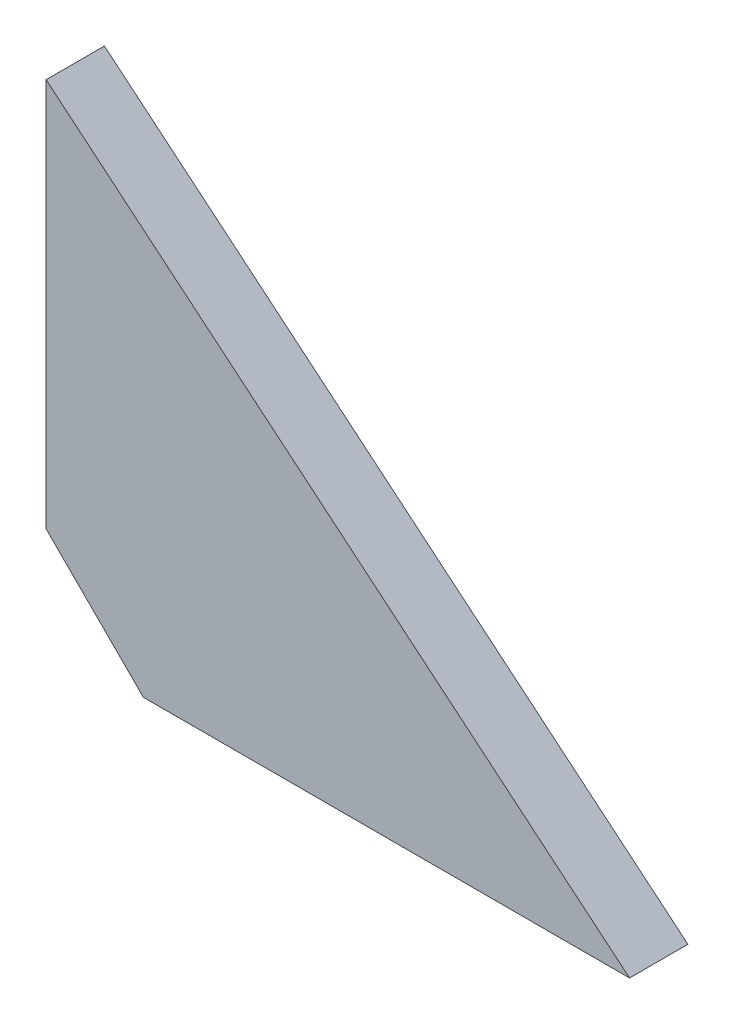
ISO-10303-21;
HEADER;
FILE_DESCRIPTION(('STEP AP214'),'2;1');
FILE_NAME('part.step','',(''),(''),'','','');
FILE_SCHEMA(('AUTOMOTIVE_DESIGN { 1 0 10303 214 1 1 1 1 }'));
ENDSEC;
DATA;
#1=APPLICATION_CONTEXT('core data for automotive mechanical design processes');
#2=APPLICATION_PROTOCOL_DEFINITION('international standard','automotive_design',2000,#1);
#3=PRODUCT_CONTEXT('',#1,'mechanical');
#4=PRODUCT('Part','Part','',(#3));
#5=PRODUCT_RELATED_PRODUCT_CATEGORY('part','',(#4));
#6=PRODUCT_DEFINITION_FORMATION('','',#4);
#7=PRODUCT_DEFINITION_CONTEXT('part definition',#1,'design');
#8=PRODUCT_DEFINITION('design','',#6,#7);
#9=PRODUCT_DEFINITION_SHAPE('','',#8);
#10=(LENGTH_UNIT() NAMED_UNIT(*) SI_UNIT(.MILLI.,.METRE.));
#11=(NAMED_UNIT(*) PLANE_ANGLE_UNIT() SI_UNIT($,.RADIAN.));
#12=(NAMED_UNIT(*) SI_UNIT($,.STERADIAN.) SOLID_ANGLE_UNIT());
#13=UNCERTAINTY_MEASURE_WITH_UNIT(LENGTH_MEASURE(1.E-05),#10,'distance_accuracy_value','');
#14=(GEOMETRIC_REPRESENTATION_CONTEXT(3) GLOBAL_UNCERTAINTY_ASSIGNED_CONTEXT((#13)) GLOBAL_UNIT_ASSIGNED_CONTEXT((#10,
#11,#12)) REPRESENTATION_CONTEXT('',''));
#15=CARTESIAN_POINT('',(0.,0.,0.));
#16=DIRECTION('',(0.,0.,1.));
#17=DIRECTION('',(1.,0.,0.));
#18=AXIS2_PLACEMENT_3D('',#15,#16,#17);
#19=CARTESIAN_POINT('',(60.,0.,6.));
#20=DIRECTION('',(-0.64018439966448,-0.768221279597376,0.));
#21=DIRECTION('',(0.768221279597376,-0.64018439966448,0.));
#22=AXIS2_PLACEMENT_3D('',#19,#20,#21);
#23=PLANE('',#22);
#24=DIRECTION('',(-0.768221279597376,0.64018439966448,0.));
#25=VECTOR('',#24,1.);
#26=CARTESIAN_POINT('',(60.,0.,0.));
#27=LINE('',#26,#25);
#28=CARTESIAN_POINT('',(60.,0.,0.));
#29=VERTEX_POINT('',#28);
#30=CARTESIAN_POINT('',(0.,50.,0.));
#31=VERTEX_POINT('',#30);
#32=EDGE_CURVE('E96',#29,#31,#27,.T.);
#33=ORIENTED_EDGE('',*,*,#32,.T.);
#34=DIRECTION('',(0.,0.,-1.));
#35=VECTOR('',#34,1.);
#36=CARTESIAN_POINT('',(0.,50.,6.));
#37=LINE('',#36,#35);
#38=CARTESIAN_POINT('',(0.,50.,6.));
#39=VERTEX_POINT('',#38);
#40=EDGE_CURVE('E80',#39,#31,#37,.T.);
#41=ORIENTED_EDGE('',*,*,#40,.F.);
#42=DIRECTION('',(-0.768221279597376,0.64018439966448,0.));
#43=VECTOR('',#42,1.);
#44=CARTESIAN_POINT('',(60.,0.,6.));
#45=LINE('',#44,#43);
#46=CARTESIAN_POINT('',(60.,0.,6.));
#47=VERTEX_POINT('',#46);
#48=EDGE_CURVE('E85',#47,#39,#45,.T.);
#49=ORIENTED_EDGE('',*,*,#48,.F.);
#50=DIRECTION('',(0.,0.,-1.));
#51=VECTOR('',#50,1.);
#52=CARTESIAN_POINT('',(60.,0.,6.));
#53=LINE('',#52,#51);
#54=EDGE_CURVE('E98',#47,#29,#53,.T.);
#55=ORIENTED_EDGE('',*,*,#54,.T.);
#56=EDGE_LOOP('',(#33,#41,#49,#55));
#57=FACE_BOUND('',#56,.T.);
#58=ADVANCED_FACE('F39',(#57),#23,.F.);
#59=CARTESIAN_POINT('',(0.,50.,6.));
#60=DIRECTION('',(1.,0.,0.));
#61=DIRECTION('',(0.,1.,0.));
#62=AXIS2_PLACEMENT_3D('',#59,#60,#61);
#63=PLANE('',#62);
#64=DIRECTION('',(0.,-1.,0.));
#65=VECTOR('',#64,1.);
#66=CARTESIAN_POINT('',(0.,50.,0.));
#67=LINE('',#66,#65);
#68=CARTESIAN_POINT('',(0.,10.,0.));
#69=VERTEX_POINT('',#68);
#70=EDGE_CURVE('E106',#31,#69,#67,.T.);
#71=ORIENTED_EDGE('',*,*,#70,.T.);
#72=DIRECTION('',(0.,0.,1.));
#73=VECTOR('',#72,1.);
#74=CARTESIAN_POINT('',(0.,10.,6.));
#75=LINE('',#74,#73);
#76=CARTESIAN_POINT('',(0.,10.,6.));
#77=VERTEX_POINT('',#76);
#78=EDGE_CURVE('E47',#69,#77,#75,.T.);
#79=ORIENTED_EDGE('',*,*,#78,.T.);
#80=DIRECTION('',(0.,-1.,0.));
#81=VECTOR('',#80,1.);
#82=CARTESIAN_POINT('',(0.,50.,6.));
#83=LINE('',#82,#81);
#84=EDGE_CURVE('E76',#39,#77,#83,.T.);
#85=ORIENTED_EDGE('',*,*,#84,.F.);
#86=ORIENTED_EDGE('',*,*,#40,.T.);
#87=EDGE_LOOP('',(#71,#79,#85,#86));
#88=FACE_BOUND('',#87,.T.);
#89=ADVANCED_FACE('F78',(#88),#63,.F.);
#90=CARTESIAN_POINT('',(0.,0.,6.));
#91=DIRECTION('',(0.,1.,0.));
#92=DIRECTION('',(0.,0.,1.));
#93=AXIS2_PLACEMENT_3D('',#90,#91,#92);
#94=PLANE('',#93);
#95=DIRECTION('',(1.,0.,0.));
#96=VECTOR('',#95,1.);
#97=CARTESIAN_POINT('',(0.,0.,6.));
#98=LINE('',#97,#96);
#99=CARTESIAN_POINT('',(10.,0.,6.));
#100=VERTEX_POINT('',#99);
#101=EDGE_CURVE('E84',#100,#47,#98,.T.);
#102=ORIENTED_EDGE('',*,*,#101,.F.);
#103=DIRECTION('',(0.,0.,-1.));
#104=VECTOR('',#103,1.);
#105=CARTESIAN_POINT('',(10.,0.,6.));
#106=LINE('',#105,#104);
#107=CARTESIAN_POINT('',(10.,0.,0.));
#108=VERTEX_POINT('',#107);
#109=EDGE_CURVE('E97',#100,#108,#106,.T.);
#110=ORIENTED_EDGE('',*,*,#109,.T.);
#111=DIRECTION('',(1.,0.,0.));
#112=VECTOR('',#111,1.);
#113=CARTESIAN_POINT('',(0.,0.,0.));
#114=LINE('',#113,#112);
#115=EDGE_CURVE('E93',#108,#29,#114,.T.);
#116=ORIENTED_EDGE('',*,*,#115,.T.);
#117=ORIENTED_EDGE('',*,*,#54,.F.);
#118=EDGE_LOOP('',(#102,#110,#116,#117));
#119=FACE_BOUND('',#118,.T.);
#120=ADVANCED_FACE('F112',(#119),#94,.F.);
#121=CARTESIAN_POINT('',(0.,50.,6.));
#122=DIRECTION('',(0.,0.,1.));
#123=DIRECTION('',(1.,0.,0.));
#124=AXIS2_PLACEMENT_3D('',#121,#122,#123);
#125=PLANE('',#124);
#126=ORIENTED_EDGE('',*,*,#84,.T.);
#127=DIRECTION('',(-0.707106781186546,0.707106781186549,0.));
#128=VECTOR('',#127,1.);
#129=CARTESIAN_POINT('',(-20.,30.0000000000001,6.));
#130=LINE('',#129,#128);
#131=EDGE_CURVE('E11',#77,#100,#130,.F.);
#132=ORIENTED_EDGE('',*,*,#131,.T.);
#133=ORIENTED_EDGE('',*,*,#101,.T.);
#134=ORIENTED_EDGE('',*,*,#48,.T.);
#135=EDGE_LOOP('',(#126,#132,#133,#134));
#136=FACE_BOUND('',#135,.T.);
#137=ADVANCED_FACE('F88',(#136),#125,.T.);
#138=CARTESIAN_POINT('',(0.,50.,0.));
#139=DIRECTION('',(0.,0.,1.));
#140=DIRECTION('',(1.,0.,0.));
#141=AXIS2_PLACEMENT_3D('',#138,#139,#140);
#142=PLANE('',#141);
#143=ORIENTED_EDGE('',*,*,#115,.F.);
#144=DIRECTION('',(0.707106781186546,-0.707106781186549,0.));
#145=VECTOR('',#144,1.);
#146=CARTESIAN_POINT('',(10.,0.,0.));
#147=LINE('',#146,#145);
#148=EDGE_CURVE('E61',#108,#69,#147,.F.);
#149=ORIENTED_EDGE('',*,*,#148,.T.);
#150=ORIENTED_EDGE('',*,*,#70,.F.);
#151=ORIENTED_EDGE('',*,*,#32,.F.);
#152=EDGE_LOOP('',(#143,#149,#150,#151));
#153=FACE_BOUND('',#152,.T.);
#154=ADVANCED_FACE('F113',(#153),#142,.F.);
#155=CARTESIAN_POINT('',(10.,0.,6.));
#156=DIRECTION('',(0.707106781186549,0.707106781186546,0.));
#157=DIRECTION('',(-0.707106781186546,0.707106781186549,0.));
#158=AXIS2_PLACEMENT_3D('',#155,#156,#157);
#159=PLANE('',#158);
#160=ORIENTED_EDGE('',*,*,#131,.F.);
#161=ORIENTED_EDGE('',*,*,#78,.F.);
#162=ORIENTED_EDGE('',*,*,#148,.F.);
#163=ORIENTED_EDGE('',*,*,#109,.F.);
#164=EDGE_LOOP('',(#160,#161,#162,#163));
#165=FACE_BOUND('',#164,.T.);
#166=ADVANCED_FACE('F41',(#165),#159,.F.);
#167=CLOSED_SHELL('',(#58,#89,#120,#137,#154,#166));
#168=MANIFOLD_SOLID_BREP('B2',#167);
#169=ADVANCED_BREP_SHAPE_REPRESENTATION('',(#18,#168),#14);
#170=SHAPE_DEFINITION_REPRESENTATION(#9,#169);
ENDSEC;
END-ISO-10303-21;
